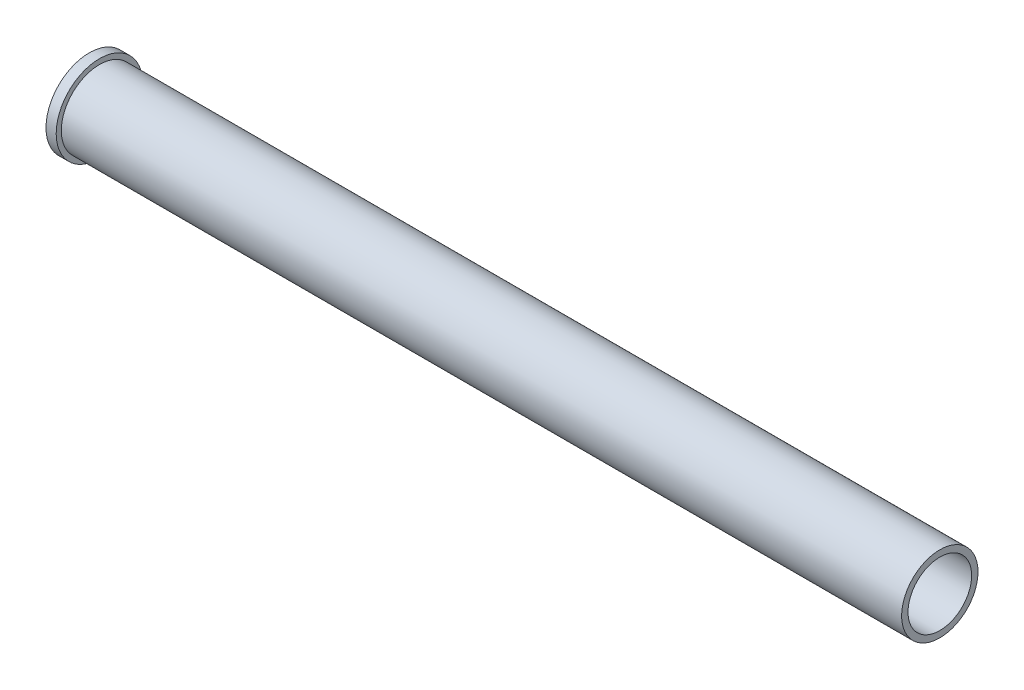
ISO-10303-21;
HEADER;
FILE_DESCRIPTION(('STEP AP214'),'2;1');
FILE_NAME('part.step','',(''),(''),'','','');
FILE_SCHEMA(('AUTOMOTIVE_DESIGN { 1 0 10303 214 1 1 1 1 }'));
ENDSEC;
DATA;
#1=APPLICATION_CONTEXT('core data for automotive mechanical design processes');
#2=APPLICATION_PROTOCOL_DEFINITION('international standard','automotive_design',2000,#1);
#3=PRODUCT_CONTEXT('',#1,'mechanical');
#4=PRODUCT('Part','Part','',(#3));
#5=PRODUCT_RELATED_PRODUCT_CATEGORY('part','',(#4));
#6=PRODUCT_DEFINITION_FORMATION('','',#4);
#7=PRODUCT_DEFINITION_CONTEXT('part definition',#1,'design');
#8=PRODUCT_DEFINITION('design','',#6,#7);
#9=PRODUCT_DEFINITION_SHAPE('','',#8);
#10=(LENGTH_UNIT() NAMED_UNIT(*) SI_UNIT(.MILLI.,.METRE.));
#11=(NAMED_UNIT(*) PLANE_ANGLE_UNIT() SI_UNIT($,.RADIAN.));
#12=(NAMED_UNIT(*) SI_UNIT($,.STERADIAN.) SOLID_ANGLE_UNIT());
#13=UNCERTAINTY_MEASURE_WITH_UNIT(LENGTH_MEASURE(1.E-05),#10,'distance_accuracy_value','');
#14=(GEOMETRIC_REPRESENTATION_CONTEXT(3) GLOBAL_UNCERTAINTY_ASSIGNED_CONTEXT((#13)) GLOBAL_UNIT_ASSIGNED_CONTEXT((#10,
#11,#12)) REPRESENTATION_CONTEXT('',''));
#15=CARTESIAN_POINT('',(0.,0.,0.));
#16=DIRECTION('',(0.,0.,1.));
#17=DIRECTION('',(1.,0.,0.));
#18=AXIS2_PLACEMENT_3D('',#15,#16,#17);
#19=CARTESIAN_POINT('',(165.1,0.,0.));
#20=DIRECTION('',(-1.,0.,0.));
#21=DIRECTION('',(0.,0.,1.));
#22=AXIS2_PLACEMENT_3D('',#19,#20,#21);
#23=CYLINDRICAL_SURFACE('',#22,5.);
#24=CARTESIAN_POINT('',(139.7,0.,0.));
#25=DIRECTION('',(1.,0.,0.));
#26=DIRECTION('',(0.,0.,-1.));
#27=AXIS2_PLACEMENT_3D('',#24,#25,#26);
#28=CIRCLE('',#27,5.);
#29=CARTESIAN_POINT('',(139.7,0.,-5.));
#30=VERTEX_POINT('',#29);
#31=EDGE_CURVE('E47',#30,#30,#28,.T.);
#32=ORIENTED_EDGE('',*,*,#31,.T.);
#33=EDGE_LOOP('',(#32));
#34=FACE_BOUND('',#33,.T.);
#35=CARTESIAN_POINT('',(-2.,0.,0.));
#36=DIRECTION('',(-1.,0.,0.));
#37=DIRECTION('',(0.,0.,1.));
#38=AXIS2_PLACEMENT_3D('',#35,#36,#37);
#39=CIRCLE('',#38,5.);
#40=CARTESIAN_POINT('',(-2.,0.,5.));
#41=VERTEX_POINT('',#40);
#42=EDGE_CURVE('E77',#41,#41,#39,.T.);
#43=ORIENTED_EDGE('',*,*,#42,.T.);
#44=EDGE_LOOP('',(#43));
#45=FACE_BOUND('',#44,.T.);
#46=ADVANCED_FACE('F43',(#34,#45),#23,.F.);
#47=CARTESIAN_POINT('',(165.1,0.,0.));
#48=DIRECTION('',(1.,0.,0.));
#49=DIRECTION('',(0.,0.,-1.));
#50=AXIS2_PLACEMENT_3D('',#47,#48,#49);
#51=PLANE('',#50);
#52=CARTESIAN_POINT('',(165.1,0.,0.));
#53=DIRECTION('',(1.,0.,0.));
#54=DIRECTION('',(0.,0.,-1.));
#55=AXIS2_PLACEMENT_3D('',#52,#53,#54);
#56=CIRCLE('',#55,6.25);
#57=CARTESIAN_POINT('',(165.1,0.,-6.25));
#58=VERTEX_POINT('',#57);
#59=EDGE_CURVE('E59',#58,#58,#56,.T.);
#60=ORIENTED_EDGE('',*,*,#59,.F.);
#61=EDGE_LOOP('',(#60));
#62=FACE_BOUND('',#61,.T.);
#63=CARTESIAN_POINT('',(165.1,0.,0.));
#64=DIRECTION('',(1.,0.,0.));
#65=DIRECTION('',(0.,0.,-1.));
#66=AXIS2_PLACEMENT_3D('',#63,#64,#65);
#67=CIRCLE('',#66,7.5);
#68=CARTESIAN_POINT('',(165.1,0.,-7.5));
#69=VERTEX_POINT('',#68);
#70=EDGE_CURVE('E10',#69,#69,#67,.T.);
#71=ORIENTED_EDGE('',*,*,#70,.T.);
#72=EDGE_LOOP('',(#71));
#73=FACE_BOUND('',#72,.T.);
#74=ADVANCED_FACE('F92',(#62,#73),#51,.T.);
#75=CARTESIAN_POINT('',(165.1,0.,0.));
#76=DIRECTION('',(-1.,0.,0.));
#77=DIRECTION('',(0.,0.,1.));
#78=AXIS2_PLACEMENT_3D('',#75,#76,#77);
#79=CYLINDRICAL_SURFACE('',#78,7.5);
#80=ORIENTED_EDGE('',*,*,#70,.F.);
#81=EDGE_LOOP('',(#80));
#82=FACE_BOUND('',#81,.T.);
#83=CARTESIAN_POINT('',(0.,0.,0.));
#84=DIRECTION('',(1.,0.,0.));
#85=DIRECTION('',(0.,0.,-1.));
#86=AXIS2_PLACEMENT_3D('',#83,#84,#85);
#87=CIRCLE('',#86,7.5);
#88=CARTESIAN_POINT('',(0.,0.,-7.5));
#89=VERTEX_POINT('',#88);
#90=EDGE_CURVE('E61',#89,#89,#87,.T.);
#91=ORIENTED_EDGE('',*,*,#90,.T.);
#92=EDGE_LOOP('',(#91));
#93=FACE_BOUND('',#92,.T.);
#94=ADVANCED_FACE('F45',(#82,#93),#79,.T.);
#95=CARTESIAN_POINT('',(139.7,0.,0.));
#96=DIRECTION('',(1.,0.,0.));
#97=DIRECTION('',(0.,0.,-1.));
#98=AXIS2_PLACEMENT_3D('',#95,#96,#97);
#99=CYLINDRICAL_SURFACE('',#98,6.25);
#100=CARTESIAN_POINT('',(139.7,0.,0.));
#101=DIRECTION('',(1.,0.,0.));
#102=DIRECTION('',(0.,0.,-1.));
#103=AXIS2_PLACEMENT_3D('',#100,#101,#102);
#104=CIRCLE('',#103,6.25);
#105=CARTESIAN_POINT('',(139.7,0.,-6.25));
#106=VERTEX_POINT('',#105);
#107=EDGE_CURVE('E57',#106,#106,#104,.T.);
#108=ORIENTED_EDGE('',*,*,#107,.F.);
#109=EDGE_LOOP('',(#108));
#110=FACE_BOUND('',#109,.T.);
#111=ORIENTED_EDGE('',*,*,#59,.T.);
#112=EDGE_LOOP('',(#111));
#113=FACE_BOUND('',#112,.T.);
#114=ADVANCED_FACE('F86',(#110,#113),#99,.F.);
#115=CARTESIAN_POINT('',(139.7,0.,0.));
#116=DIRECTION('',(1.,0.,0.));
#117=DIRECTION('',(0.,0.,-1.));
#118=AXIS2_PLACEMENT_3D('',#115,#116,#117);
#119=PLANE('',#118);
#120=ORIENTED_EDGE('',*,*,#31,.F.);
#121=EDGE_LOOP('',(#120));
#122=FACE_BOUND('',#121,.T.);
#123=ORIENTED_EDGE('',*,*,#107,.T.);
#124=EDGE_LOOP('',(#123));
#125=FACE_BOUND('',#124,.T.);
#126=ADVANCED_FACE('F84',(#122,#125),#119,.T.);
#127=CARTESIAN_POINT('',(-2.,0.,0.));
#128=DIRECTION('',(-1.,0.,0.));
#129=DIRECTION('',(0.,0.,1.));
#130=AXIS2_PLACEMENT_3D('',#127,#128,#129);
#131=PLANE('',#130);
#132=CARTESIAN_POINT('',(-2.,0.,0.));
#133=DIRECTION('',(-1.,0.,0.));
#134=DIRECTION('',(0.,0.,1.));
#135=AXIS2_PLACEMENT_3D('',#132,#133,#134);
#136=CIRCLE('',#135,8.5);
#137=CARTESIAN_POINT('',(-2.,0.,8.5));
#138=VERTEX_POINT('',#137);
#139=EDGE_CURVE('E64',#138,#138,#136,.T.);
#140=ORIENTED_EDGE('',*,*,#139,.T.);
#141=EDGE_LOOP('',(#140));
#142=FACE_BOUND('',#141,.T.);
#143=ORIENTED_EDGE('',*,*,#42,.F.);
#144=EDGE_LOOP('',(#143));
#145=FACE_BOUND('',#144,.T.);
#146=ADVANCED_FACE('F104',(#142,#145),#131,.T.);
#147=CARTESIAN_POINT('',(0.,0.,0.));
#148=DIRECTION('',(-1.,0.,0.));
#149=DIRECTION('',(0.,0.,1.));
#150=AXIS2_PLACEMENT_3D('',#147,#148,#149);
#151=PLANE('',#150);
#152=ORIENTED_EDGE('',*,*,#90,.F.);
#153=EDGE_LOOP('',(#152));
#154=FACE_BOUND('',#153,.T.);
#155=CARTESIAN_POINT('',(0.,0.,0.));
#156=DIRECTION('',(-1.,0.,0.));
#157=DIRECTION('',(0.,0.,1.));
#158=AXIS2_PLACEMENT_3D('',#155,#156,#157);
#159=CIRCLE('',#158,8.5);
#160=CARTESIAN_POINT('',(0.,0.,8.5));
#161=VERTEX_POINT('',#160);
#162=EDGE_CURVE('E71',#161,#161,#159,.T.);
#163=ORIENTED_EDGE('',*,*,#162,.F.);
#164=EDGE_LOOP('',(#163));
#165=FACE_BOUND('',#164,.T.);
#166=ADVANCED_FACE('F109',(#154,#165),#151,.F.);
#167=CARTESIAN_POINT('',(-2.,0.,0.));
#168=DIRECTION('',(1.,0.,0.));
#169=DIRECTION('',(0.,0.,-1.));
#170=AXIS2_PLACEMENT_3D('',#167,#168,#169);
#171=CYLINDRICAL_SURFACE('',#170,8.5);
#172=ORIENTED_EDGE('',*,*,#139,.F.);
#173=EDGE_LOOP('',(#172));
#174=FACE_BOUND('',#173,.T.);
#175=ORIENTED_EDGE('',*,*,#162,.T.);
#176=EDGE_LOOP('',(#175));
#177=FACE_BOUND('',#176,.T.);
#178=ADVANCED_FACE('F106',(#174,#177),#171,.T.);
#179=CLOSED_SHELL('',(#46,#74,#94,#114,#126,#146,#166,#178));
#180=MANIFOLD_SOLID_BREP('B2',#179);
#181=ADVANCED_BREP_SHAPE_REPRESENTATION('',(#18,#180),#14);
#182=SHAPE_DEFINITION_REPRESENTATION(#9,#181);
ENDSEC;
END-ISO-10303-21;
